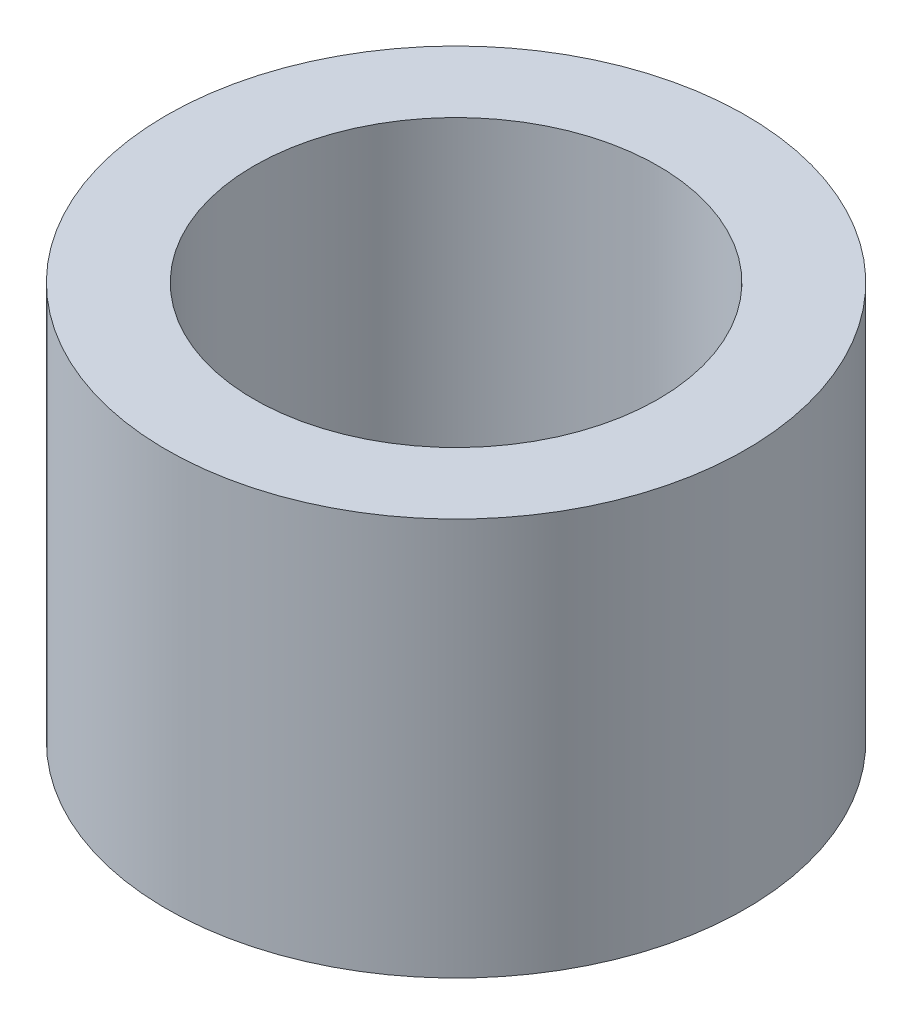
ISO-10303-21;
HEADER;
FILE_DESCRIPTION(('STEP AP214'),'2;1');
FILE_NAME('part.step','',(''),(''),'','','');
FILE_SCHEMA(('AUTOMOTIVE_DESIGN { 1 0 10303 214 1 1 1 1 }'));
ENDSEC;
DATA;
#1=APPLICATION_CONTEXT('core data for automotive mechanical design processes');
#2=APPLICATION_PROTOCOL_DEFINITION('international standard','automotive_design',2000,#1);
#3=PRODUCT_CONTEXT('',#1,'mechanical');
#4=PRODUCT('Part','Part','',(#3));
#5=PRODUCT_RELATED_PRODUCT_CATEGORY('part','',(#4));
#6=PRODUCT_DEFINITION_FORMATION('','',#4);
#7=PRODUCT_DEFINITION_CONTEXT('part definition',#1,'design');
#8=PRODUCT_DEFINITION('design','',#6,#7);
#9=PRODUCT_DEFINITION_SHAPE('','',#8);
#10=(LENGTH_UNIT() NAMED_UNIT(*) SI_UNIT(.MILLI.,.METRE.));
#11=(NAMED_UNIT(*) PLANE_ANGLE_UNIT() SI_UNIT($,.RADIAN.));
#12=(NAMED_UNIT(*) SI_UNIT($,.STERADIAN.) SOLID_ANGLE_UNIT());
#13=UNCERTAINTY_MEASURE_WITH_UNIT(LENGTH_MEASURE(1.E-05),#10,'distance_accuracy_value','');
#14=(GEOMETRIC_REPRESENTATION_CONTEXT(3) GLOBAL_UNCERTAINTY_ASSIGNED_CONTEXT((#13)) GLOBAL_UNIT_ASSIGNED_CONTEXT((#10,
#11,#12)) REPRESENTATION_CONTEXT('',''));
#15=CARTESIAN_POINT('',(0.,0.,0.));
#16=DIRECTION('',(0.,0.,1.));
#17=DIRECTION('',(1.,0.,0.));
#18=AXIS2_PLACEMENT_3D('',#15,#16,#17);
#19=CARTESIAN_POINT('',(2.15,0.,0.));
#20=DIRECTION('',(0.,1.,0.));
#21=DIRECTION('',(-1.,0.,0.));
#22=AXIS2_PLACEMENT_3D('',#19,#20,#21);
#23=PLANE('',#22);
#24=CARTESIAN_POINT('',(0.,0.,0.));
#25=DIRECTION('',(0.,1.,0.));
#26=DIRECTION('',(-1.,0.,0.));
#27=AXIS2_PLACEMENT_3D('',#24,#25,#26);
#28=CIRCLE('',#27,2.15);
#29=CARTESIAN_POINT('',(-2.15,0.,0.));
#30=VERTEX_POINT('',#29);
#31=EDGE_CURVE('E47',#30,#30,#28,.T.);
#32=ORIENTED_EDGE('',*,*,#31,.F.);
#33=EDGE_LOOP('',(#32));
#34=FACE_BOUND('',#33,.T.);
#35=CARTESIAN_POINT('',(0.,0.,0.));
#36=DIRECTION('',(0.,1.,0.));
#37=DIRECTION('',(-1.,0.,0.));
#38=AXIS2_PLACEMENT_3D('',#35,#36,#37);
#39=CIRCLE('',#38,1.5);
#40=CARTESIAN_POINT('',(-1.5,0.,0.));
#41=VERTEX_POINT('',#40);
#42=EDGE_CURVE('E10',#41,#41,#39,.T.);
#43=ORIENTED_EDGE('',*,*,#42,.T.);
#44=EDGE_LOOP('',(#43));
#45=FACE_BOUND('',#44,.T.);
#46=ADVANCED_FACE('F33',(#34,#45),#23,.F.);
#47=CARTESIAN_POINT('',(0.,25.2722865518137,0.));
#48=DIRECTION('',(0.,1.,0.));
#49=DIRECTION('',(-1.,0.,0.));
#50=AXIS2_PLACEMENT_3D('',#47,#48,#49);
#51=CYLINDRICAL_SURFACE('',#50,1.5);
#52=ORIENTED_EDGE('',*,*,#42,.F.);
#53=EDGE_LOOP('',(#52));
#54=FACE_BOUND('',#53,.T.);
#55=CARTESIAN_POINT('',(0.,2.95,0.));
#56=DIRECTION('',(0.,1.,0.));
#57=DIRECTION('',(-1.,0.,0.));
#58=AXIS2_PLACEMENT_3D('',#55,#56,#57);
#59=CIRCLE('',#58,1.5);
#60=CARTESIAN_POINT('',(-1.5,2.95,0.));
#61=VERTEX_POINT('',#60);
#62=EDGE_CURVE('E39',#61,#61,#59,.T.);
#63=ORIENTED_EDGE('',*,*,#62,.T.);
#64=EDGE_LOOP('',(#63));
#65=FACE_BOUND('',#64,.T.);
#66=ADVANCED_FACE('F56',(#54,#65),#51,.F.);
#67=CARTESIAN_POINT('',(1.5,2.95,0.));
#68=DIRECTION('',(0.,-1.,0.));
#69=DIRECTION('',(1.,0.,0.));
#70=AXIS2_PLACEMENT_3D('',#67,#68,#69);
#71=PLANE('',#70);
#72=ORIENTED_EDGE('',*,*,#62,.F.);
#73=EDGE_LOOP('',(#72));
#74=FACE_BOUND('',#73,.T.);
#75=CARTESIAN_POINT('',(0.,2.95,0.));
#76=DIRECTION('',(0.,1.,0.));
#77=DIRECTION('',(-1.,0.,0.));
#78=AXIS2_PLACEMENT_3D('',#75,#76,#77);
#79=CIRCLE('',#78,2.15);
#80=CARTESIAN_POINT('',(-2.15,2.95,0.));
#81=VERTEX_POINT('',#80);
#82=EDGE_CURVE('E43',#81,#81,#79,.T.);
#83=ORIENTED_EDGE('',*,*,#82,.T.);
#84=EDGE_LOOP('',(#83));
#85=FACE_BOUND('',#84,.T.);
#86=ADVANCED_FACE('F60',(#74,#85),#71,.F.);
#87=CARTESIAN_POINT('',(0.,25.2722865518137,0.));
#88=DIRECTION('',(0.,1.,0.));
#89=DIRECTION('',(-1.,0.,0.));
#90=AXIS2_PLACEMENT_3D('',#87,#88,#89);
#91=CYLINDRICAL_SURFACE('',#90,2.15);
#92=ORIENTED_EDGE('',*,*,#82,.F.);
#93=EDGE_LOOP('',(#92));
#94=FACE_BOUND('',#93,.T.);
#95=ORIENTED_EDGE('',*,*,#31,.T.);
#96=EDGE_LOOP('',(#95));
#97=FACE_BOUND('',#96,.T.);
#98=ADVANCED_FACE('F53',(#94,#97),#91,.T.);
#99=CLOSED_SHELL('',(#46,#66,#86,#98));
#100=MANIFOLD_SOLID_BREP('B2',#99);
#101=ADVANCED_BREP_SHAPE_REPRESENTATION('',(#18,#100),#14);
#102=SHAPE_DEFINITION_REPRESENTATION(#9,#101);
ENDSEC;
END-ISO-10303-21;
